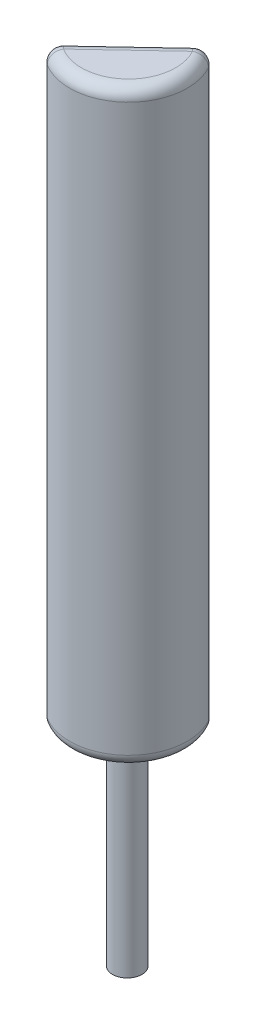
from build123d import *

# Parameters (mm, degrees)
ESTRUSIONE_ESTRUSIONE1_DEPTH = 40
SCHIZZO2_R                   = 1
ESTRUSIONE_ESTRUSIONE2_DEPTH = 13
RACCORDO1_R                  = 0.8


with BuildPart() as part:
    # Schizzo1 → Estrusione-Estrusione1 (new body)
    with BuildSketch(Plane(origin=(0, 0, 0), x_dir=(1, 0, 0), z_dir=(0, 1, 0))):
        with BuildLine():
            Line((-2.91397243, -2.740212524), (2.91397243, 2.740212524))
            ThreePointArc((2.91397243, 2.740212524), (2.740212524, -2.91397243), (-2.91397243, -2.740212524))
        make_face()
    extrude(amount=ESTRUSIONE_ESTRUSIONE1_DEPTH)

    # Schizzo2 → Estrusione-Estrusione2 (add)
    with BuildSketch(Plane.XZ):
        with Locations(Location((1.370106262, 1.456986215, 0), (0, 0, 90))):
            Circle(SCHIZZO2_R)
    extrude(amount=ESTRUSIONE_ESTRUSIONE2_DEPTH)

    # Raccordo1
    raccordo1_edges = [part.edges().sort_by_distance(p)[0] for p in [
        (0, 0, 0),
        (2.740212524, 0, 2.91397243),
        (2.740212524, 40, 2.91397243),
        (-2.91397243, 20, 2.740212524),
        (2.91397243, 20, -2.740212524),
        (0, 40, 0),
    ]]
    fillet(raccordo1_edges, radius=RACCORDO1_R)


solid = part.part
